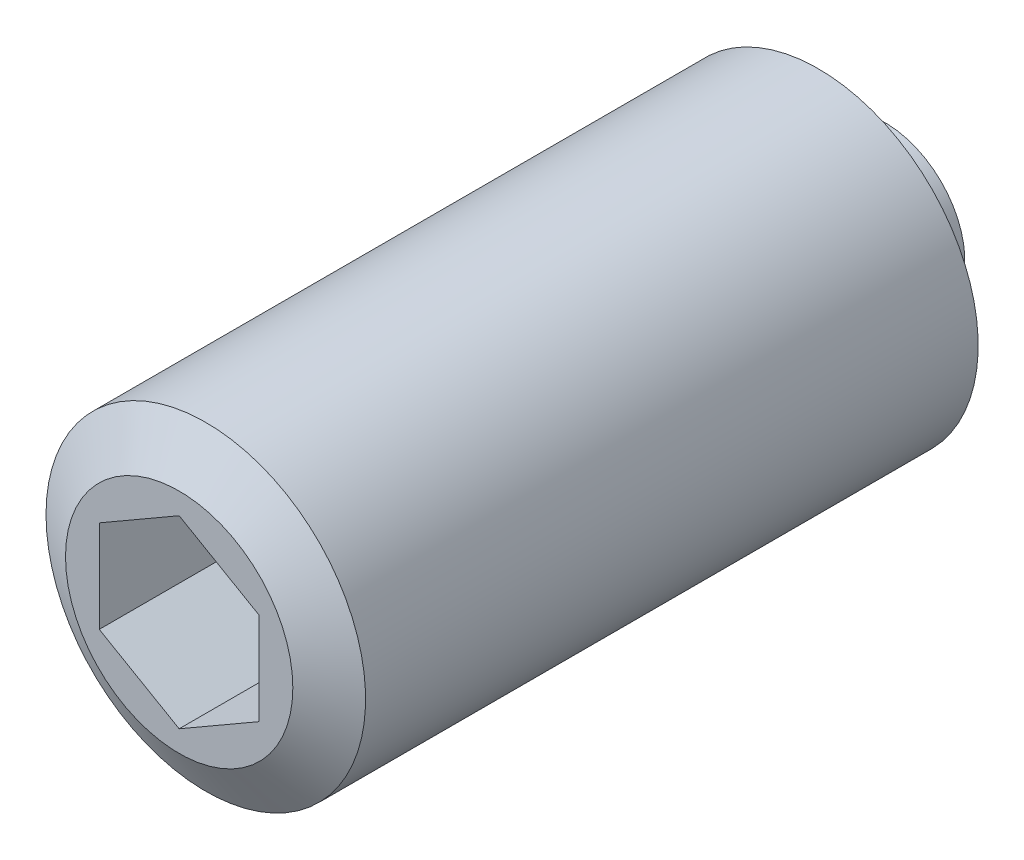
ISO-10303-21;
HEADER;
FILE_DESCRIPTION(('STEP AP214'),'2;1');
FILE_NAME('part.step','',(''),(''),'','','');
FILE_SCHEMA(('AUTOMOTIVE_DESIGN { 1 0 10303 214 1 1 1 1 }'));
ENDSEC;
DATA;
#1=APPLICATION_CONTEXT('core data for automotive mechanical design processes');
#2=APPLICATION_PROTOCOL_DEFINITION('international standard','automotive_design',2000,#1);
#3=PRODUCT_CONTEXT('',#1,'mechanical');
#4=PRODUCT('Part','Part','',(#3));
#5=PRODUCT_RELATED_PRODUCT_CATEGORY('part','',(#4));
#6=PRODUCT_DEFINITION_FORMATION('','',#4);
#7=PRODUCT_DEFINITION_CONTEXT('part definition',#1,'design');
#8=PRODUCT_DEFINITION('design','',#6,#7);
#9=PRODUCT_DEFINITION_SHAPE('','',#8);
#10=(LENGTH_UNIT() NAMED_UNIT(*) SI_UNIT(.MILLI.,.METRE.));
#11=(NAMED_UNIT(*) PLANE_ANGLE_UNIT() SI_UNIT($,.RADIAN.));
#12=(NAMED_UNIT(*) SI_UNIT($,.STERADIAN.) SOLID_ANGLE_UNIT());
#13=UNCERTAINTY_MEASURE_WITH_UNIT(LENGTH_MEASURE(1.E-05),#10,'distance_accuracy_value','');
#14=(GEOMETRIC_REPRESENTATION_CONTEXT(3) GLOBAL_UNCERTAINTY_ASSIGNED_CONTEXT((#13)) GLOBAL_UNIT_ASSIGNED_CONTEXT((#10,
#11,#12)) REPRESENTATION_CONTEXT('',''));
#15=CARTESIAN_POINT('',(0.,0.,0.));
#16=DIRECTION('',(0.,0.,1.));
#17=DIRECTION('',(1.,0.,0.));
#18=AXIS2_PLACEMENT_3D('',#15,#16,#17);
#19=CARTESIAN_POINT('',(0.,0.,26.5));
#20=DIRECTION('',(0.,0.,-1.));
#21=DIRECTION('',(-1.,0.,0.));
#22=AXIS2_PLACEMENT_3D('',#19,#20,#21);
#23=PLANE('',#22);
#24=DIRECTION('',(-0.866025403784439,-0.5,0.));
#25=VECTOR('',#24,1.);
#26=CARTESIAN_POINT('',(0.,3.46410161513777,26.5));
#27=LINE('',#26,#25);
#28=CARTESIAN_POINT('',(0.,3.46410161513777,26.5));
#29=VERTEX_POINT('',#28);
#30=CARTESIAN_POINT('',(-3.,1.73205080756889,26.5));
#31=VERTEX_POINT('',#30);
#32=EDGE_CURVE('E102',#29,#31,#27,.T.);
#33=ORIENTED_EDGE('',*,*,#32,.F.);
#34=DIRECTION('',(-0.866025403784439,0.5,0.));
#35=VECTOR('',#34,1.);
#36=CARTESIAN_POINT('',(3.,1.73205080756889,26.5));
#37=LINE('',#36,#35);
#38=CARTESIAN_POINT('',(3.,1.73205080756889,26.5));
#39=VERTEX_POINT('',#38);
#40=EDGE_CURVE('E28',#39,#29,#37,.T.);
#41=ORIENTED_EDGE('',*,*,#40,.F.);
#42=DIRECTION('',(0.,1.,0.));
#43=VECTOR('',#42,1.);
#44=CARTESIAN_POINT('',(3.,-1.73205080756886,26.5));
#45=LINE('',#44,#43);
#46=CARTESIAN_POINT('',(3.,-1.73205080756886,26.5));
#47=VERTEX_POINT('',#46);
#48=EDGE_CURVE('E111',#47,#39,#45,.T.);
#49=ORIENTED_EDGE('',*,*,#48,.F.);
#50=DIRECTION('',(0.866025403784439,0.5,0.));
#51=VECTOR('',#50,1.);
#52=CARTESIAN_POINT('',(0.,-3.46410161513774,26.5));
#53=LINE('',#52,#51);
#54=CARTESIAN_POINT('',(0.,-3.46410161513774,26.5));
#55=VERTEX_POINT('',#54);
#56=EDGE_CURVE('E109',#55,#47,#53,.T.);
#57=ORIENTED_EDGE('',*,*,#56,.F.);
#58=DIRECTION('',(0.866025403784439,-0.5,0.));
#59=VECTOR('',#58,1.);
#60=CARTESIAN_POINT('',(-3.,-1.73205080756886,26.5));
#61=LINE('',#60,#59);
#62=CARTESIAN_POINT('',(-3.,-1.73205080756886,26.5));
#63=VERTEX_POINT('',#62);
#64=EDGE_CURVE('E76',#63,#55,#61,.T.);
#65=ORIENTED_EDGE('',*,*,#64,.F.);
#66=DIRECTION('',(0.,-1.,0.));
#67=VECTOR('',#66,1.);
#68=CARTESIAN_POINT('',(-3.,1.73205080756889,26.5));
#69=LINE('',#68,#67);
#70=EDGE_CURVE('E105',#31,#63,#69,.T.);
#71=ORIENTED_EDGE('',*,*,#70,.F.);
#72=EDGE_LOOP('',(#33,#41,#49,#57,#65,#71));
#73=FACE_BOUND('',#72,.T.);
#74=CARTESIAN_POINT('',(0.,0.,26.5));
#75=DIRECTION('',(0.,0.,-1.));
#76=DIRECTION('',(-1.,0.,0.));
#77=AXIS2_PLACEMENT_3D('',#74,#75,#76);
#78=CIRCLE('',#77,4.267949);
#79=CARTESIAN_POINT('',(-4.267949,0.,26.5));
#80=VERTEX_POINT('',#79);
#81=EDGE_CURVE('E9',#80,#80,#78,.T.);
#82=ORIENTED_EDGE('',*,*,#81,.F.);
#83=EDGE_LOOP('',(#82));
#84=FACE_BOUND('',#83,.T.);
#85=ADVANCED_FACE('F14',(#73,#84),#23,.F.);
#86=CARTESIAN_POINT('',(0.,0.,26.5));
#87=DIRECTION('',(0.,0.,-1.));
#88=DIRECTION('',(-1.,0.,0.));
#89=AXIS2_PLACEMENT_3D('',#86,#87,#88);
#90=CONICAL_SURFACE('',#89,4.267949,1.04719759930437);
#91=CARTESIAN_POINT('',(0.,0.,25.5));
#92=DIRECTION('',(0.,0.,-1.));
#93=DIRECTION('',(-1.,0.,0.));
#94=AXIS2_PLACEMENT_3D('',#91,#92,#93);
#95=CIRCLE('',#94,6.);
#96=CARTESIAN_POINT('',(-6.,0.,25.5));
#97=VERTEX_POINT('',#96);
#98=EDGE_CURVE('E21',#97,#97,#95,.T.);
#99=ORIENTED_EDGE('',*,*,#98,.F.);
#100=EDGE_LOOP('',(#99));
#101=FACE_BOUND('',#100,.T.);
#102=ORIENTED_EDGE('',*,*,#81,.T.);
#103=EDGE_LOOP('',(#102));
#104=FACE_BOUND('',#103,.T.);
#105=ADVANCED_FACE('F136',(#101,#104),#90,.T.);
#106=CARTESIAN_POINT('',(0.,0.,0.));
#107=DIRECTION('',(0.,0.,-1.));
#108=DIRECTION('',(-1.,0.,0.));
#109=AXIS2_PLACEMENT_3D('',#106,#107,#108);
#110=CYLINDRICAL_SURFACE('',#109,6.);
#111=CARTESIAN_POINT('',(0.,0.,2.5));
#112=DIRECTION('',(0.,0.,-1.));
#113=DIRECTION('',(-1.,0.,0.));
#114=AXIS2_PLACEMENT_3D('',#111,#112,#113);
#115=CIRCLE('',#114,6.);
#116=CARTESIAN_POINT('',(-6.,0.,2.5));
#117=VERTEX_POINT('',#116);
#118=EDGE_CURVE('E129',#117,#117,#115,.T.);
#119=ORIENTED_EDGE('',*,*,#118,.F.);
#120=EDGE_LOOP('',(#119));
#121=FACE_BOUND('',#120,.T.);
#122=ORIENTED_EDGE('',*,*,#98,.T.);
#123=EDGE_LOOP('',(#122));
#124=FACE_BOUND('',#123,.T.);
#125=ADVANCED_FACE('F134',(#121,#124),#110,.T.);
#126=CARTESIAN_POINT('',(0.,0.,2.5));
#127=DIRECTION('',(0.,0.,1.));
#128=DIRECTION('',(1.,0.,0.));
#129=AXIS2_PLACEMENT_3D('',#126,#127,#128);
#130=CONICAL_SURFACE('',#129,6.,1.04719759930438);
#131=CARTESIAN_POINT('',(0.,0.,1.5));
#132=DIRECTION('',(0.,0.,-1.));
#133=DIRECTION('',(-1.,0.,0.));
#134=AXIS2_PLACEMENT_3D('',#131,#132,#133);
#135=CIRCLE('',#134,4.267949);
#136=CARTESIAN_POINT('',(-4.267949,0.,1.5));
#137=VERTEX_POINT('',#136);
#138=EDGE_CURVE('E126',#137,#137,#135,.T.);
#139=ORIENTED_EDGE('',*,*,#138,.F.);
#140=EDGE_LOOP('',(#139));
#141=FACE_BOUND('',#140,.T.);
#142=ORIENTED_EDGE('',*,*,#118,.T.);
#143=EDGE_LOOP('',(#142));
#144=FACE_BOUND('',#143,.T.);
#145=ADVANCED_FACE('F176',(#141,#144),#130,.T.);
#146=CARTESIAN_POINT('',(0.,3.,1.5));
#147=DIRECTION('',(0.,0.,1.));
#148=DIRECTION('',(1.,0.,0.));
#149=AXIS2_PLACEMENT_3D('',#146,#147,#148);
#150=PLANE('',#149);
#151=CARTESIAN_POINT('',(0.,0.,1.5));
#152=DIRECTION('',(0.,0.,-1.));
#153=DIRECTION('',(-1.,0.,0.));
#154=AXIS2_PLACEMENT_3D('',#151,#152,#153);
#155=CIRCLE('',#154,3.);
#156=CARTESIAN_POINT('',(-3.,0.,1.5));
#157=VERTEX_POINT('',#156);
#158=EDGE_CURVE('E123',#157,#157,#155,.T.);
#159=ORIENTED_EDGE('',*,*,#158,.F.);
#160=EDGE_LOOP('',(#159));
#161=FACE_BOUND('',#160,.T.);
#162=ORIENTED_EDGE('',*,*,#138,.T.);
#163=EDGE_LOOP('',(#162));
#164=FACE_BOUND('',#163,.T.);
#165=ADVANCED_FACE('F172',(#161,#164),#150,.F.);
#166=CARTESIAN_POINT('',(0.,0.,0.));
#167=DIRECTION('',(0.,0.,-1.));
#168=DIRECTION('',(-1.,0.,0.));
#169=AXIS2_PLACEMENT_3D('',#166,#167,#168);
#170=CYLINDRICAL_SURFACE('',#169,3.);
#171=CARTESIAN_POINT('',(0.,0.,0.));
#172=DIRECTION('',(0.,0.,-1.));
#173=DIRECTION('',(-1.,0.,0.));
#174=AXIS2_PLACEMENT_3D('',#171,#172,#173);
#175=CIRCLE('',#174,3.);
#176=CARTESIAN_POINT('',(-3.,0.,0.));
#177=VERTEX_POINT('',#176);
#178=EDGE_CURVE('E115',#177,#177,#175,.T.);
#179=ORIENTED_EDGE('',*,*,#178,.F.);
#180=EDGE_LOOP('',(#179));
#181=FACE_BOUND('',#180,.T.);
#182=ORIENTED_EDGE('',*,*,#158,.T.);
#183=EDGE_LOOP('',(#182));
#184=FACE_BOUND('',#183,.T.);
#185=ADVANCED_FACE('F164',(#181,#184),#170,.T.);
#186=CARTESIAN_POINT('',(0.,0.,0.));
#187=DIRECTION('',(0.,0.,1.));
#188=DIRECTION('',(1.,0.,0.));
#189=AXIS2_PLACEMENT_3D('',#186,#187,#188);
#190=PLANE('',#189);
#191=ORIENTED_EDGE('',*,*,#178,.T.);
#192=EDGE_LOOP('',(#191));
#193=FACE_BOUND('',#192,.T.);
#194=ADVANCED_FACE('F156',(#193),#190,.F.);
#195=CARTESIAN_POINT('',(3.,1.73205080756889,21.5));
#196=DIRECTION('',(0.5,0.866025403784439,0.));
#197=DIRECTION('',(0.866025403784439,-0.5,0.));
#198=AXIS2_PLACEMENT_3D('',#195,#196,#197);
#199=PLANE('',#198);
#200=ORIENTED_EDGE('',*,*,#40,.T.);
#201=DIRECTION('',(0.,0.,1.));
#202=VECTOR('',#201,1.);
#203=CARTESIAN_POINT('',(0.,3.46410161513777,21.5));
#204=LINE('',#203,#202);
#205=CARTESIAN_POINT('',(0.,3.46410161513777,21.5));
#206=VERTEX_POINT('',#205);
#207=EDGE_CURVE('E58',#206,#29,#204,.T.);
#208=ORIENTED_EDGE('',*,*,#207,.F.);
#209=DIRECTION('',(-0.866025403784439,0.5,0.));
#210=VECTOR('',#209,1.);
#211=CARTESIAN_POINT('',(3.,1.73205080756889,21.5));
#212=LINE('',#211,#210);
#213=CARTESIAN_POINT('',(3.,1.73205080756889,21.5));
#214=VERTEX_POINT('',#213);
#215=EDGE_CURVE('E113',#214,#206,#212,.T.);
#216=ORIENTED_EDGE('',*,*,#215,.F.);
#217=DIRECTION('',(0.,0.,1.));
#218=VECTOR('',#217,1.);
#219=CARTESIAN_POINT('',(3.,1.73205080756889,21.5));
#220=LINE('',#219,#218);
#221=EDGE_CURVE('E36',#214,#39,#220,.T.);
#222=ORIENTED_EDGE('',*,*,#221,.T.);
#223=EDGE_LOOP('',(#200,#208,#216,#222));
#224=FACE_BOUND('',#223,.T.);
#225=ADVANCED_FACE('F153',(#224),#199,.F.);
#226=CARTESIAN_POINT('',(3.,-1.73205080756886,21.5));
#227=DIRECTION('',(1.,0.,0.));
#228=DIRECTION('',(0.,0.,-1.));
#229=AXIS2_PLACEMENT_3D('',#226,#227,#228);
#230=PLANE('',#229);
#231=ORIENTED_EDGE('',*,*,#48,.T.);
#232=ORIENTED_EDGE('',*,*,#221,.F.);
#233=DIRECTION('',(0.,1.,0.));
#234=VECTOR('',#233,1.);
#235=CARTESIAN_POINT('',(3.,-1.73205080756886,21.5));
#236=LINE('',#235,#234);
#237=CARTESIAN_POINT('',(3.,-1.73205080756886,21.5));
#238=VERTEX_POINT('',#237);
#239=EDGE_CURVE('E88',#238,#214,#236,.T.);
#240=ORIENTED_EDGE('',*,*,#239,.F.);
#241=DIRECTION('',(0.,0.,1.));
#242=VECTOR('',#241,1.);
#243=CARTESIAN_POINT('',(3.,-1.73205080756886,21.5));
#244=LINE('',#243,#242);
#245=EDGE_CURVE('E80',#238,#47,#244,.T.);
#246=ORIENTED_EDGE('',*,*,#245,.T.);
#247=EDGE_LOOP('',(#231,#232,#240,#246));
#248=FACE_BOUND('',#247,.T.);
#249=ADVANCED_FACE('F155',(#248),#230,.F.);
#250=CARTESIAN_POINT('',(0.,-3.46410161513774,21.5));
#251=DIRECTION('',(0.5,-0.866025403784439,0.));
#252=DIRECTION('',(-0.866025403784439,-0.5,0.));
#253=AXIS2_PLACEMENT_3D('',#250,#251,#252);
#254=PLANE('',#253);
#255=ORIENTED_EDGE('',*,*,#56,.T.);
#256=ORIENTED_EDGE('',*,*,#245,.F.);
#257=DIRECTION('',(0.866025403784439,0.5,0.));
#258=VECTOR('',#257,1.);
#259=CARTESIAN_POINT('',(0.,-3.46410161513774,21.5));
#260=LINE('',#259,#258);
#261=CARTESIAN_POINT('',(0.,-3.46410161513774,21.5));
#262=VERTEX_POINT('',#261);
#263=EDGE_CURVE('E84',#262,#238,#260,.T.);
#264=ORIENTED_EDGE('',*,*,#263,.F.);
#265=DIRECTION('',(0.,0.,1.));
#266=VECTOR('',#265,1.);
#267=CARTESIAN_POINT('',(0.,-3.46410161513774,21.5));
#268=LINE('',#267,#266);
#269=EDGE_CURVE('E69',#262,#55,#268,.T.);
#270=ORIENTED_EDGE('',*,*,#269,.T.);
#271=EDGE_LOOP('',(#255,#256,#264,#270));
#272=FACE_BOUND('',#271,.T.);
#273=ADVANCED_FACE('F85',(#272),#254,.F.);
#274=CARTESIAN_POINT('',(-3.,-1.73205080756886,21.5));
#275=DIRECTION('',(-0.5,-0.866025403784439,0.));
#276=DIRECTION('',(-0.866025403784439,0.5,0.));
#277=AXIS2_PLACEMENT_3D('',#274,#275,#276);
#278=PLANE('',#277);
#279=ORIENTED_EDGE('',*,*,#64,.T.);
#280=ORIENTED_EDGE('',*,*,#269,.F.);
#281=DIRECTION('',(0.866025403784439,-0.5,0.));
#282=VECTOR('',#281,1.);
#283=CARTESIAN_POINT('',(-3.,-1.73205080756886,21.5));
#284=LINE('',#283,#282);
#285=CARTESIAN_POINT('',(-3.,-1.73205080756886,21.5));
#286=VERTEX_POINT('',#285);
#287=EDGE_CURVE('E73',#286,#262,#284,.T.);
#288=ORIENTED_EDGE('',*,*,#287,.F.);
#289=DIRECTION('',(0.,0.,1.));
#290=VECTOR('',#289,1.);
#291=CARTESIAN_POINT('',(-3.,-1.73205080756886,21.5));
#292=LINE('',#291,#290);
#293=EDGE_CURVE('E81',#286,#63,#292,.T.);
#294=ORIENTED_EDGE('',*,*,#293,.T.);
#295=EDGE_LOOP('',(#279,#280,#288,#294));
#296=FACE_BOUND('',#295,.T.);
#297=ADVANCED_FACE('F71',(#296),#278,.F.);
#298=CARTESIAN_POINT('',(-3.,1.73205080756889,21.5));
#299=DIRECTION('',(-1.,0.,0.));
#300=DIRECTION('',(0.,0.,1.));
#301=AXIS2_PLACEMENT_3D('',#298,#299,#300);
#302=PLANE('',#301);
#303=ORIENTED_EDGE('',*,*,#70,.T.);
#304=ORIENTED_EDGE('',*,*,#293,.F.);
#305=DIRECTION('',(0.,-1.,0.));
#306=VECTOR('',#305,1.);
#307=CARTESIAN_POINT('',(-3.,1.73205080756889,21.5));
#308=LINE('',#307,#306);
#309=CARTESIAN_POINT('',(-3.,1.73205080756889,21.5));
#310=VERTEX_POINT('',#309);
#311=EDGE_CURVE('E94',#310,#286,#308,.T.);
#312=ORIENTED_EDGE('',*,*,#311,.F.);
#313=DIRECTION('',(0.,0.,1.));
#314=VECTOR('',#313,1.);
#315=CARTESIAN_POINT('',(-3.,1.73205080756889,21.5));
#316=LINE('',#315,#314);
#317=EDGE_CURVE('E118',#310,#31,#316,.T.);
#318=ORIENTED_EDGE('',*,*,#317,.T.);
#319=EDGE_LOOP('',(#303,#304,#312,#318));
#320=FACE_BOUND('',#319,.T.);
#321=ADVANCED_FACE('F252',(#320),#302,.F.);
#322=CARTESIAN_POINT('',(0.,3.46410161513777,21.5));
#323=DIRECTION('',(-0.5,0.866025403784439,0.));
#324=DIRECTION('',(0.866025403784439,0.5,0.));
#325=AXIS2_PLACEMENT_3D('',#322,#323,#324);
#326=PLANE('',#325);
#327=ORIENTED_EDGE('',*,*,#32,.T.);
#328=ORIENTED_EDGE('',*,*,#317,.F.);
#329=DIRECTION('',(-0.866025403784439,-0.5,0.));
#330=VECTOR('',#329,1.);
#331=CARTESIAN_POINT('',(0.,3.46410161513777,21.5));
#332=LINE('',#331,#330);
#333=EDGE_CURVE('E96',#206,#310,#332,.T.);
#334=ORIENTED_EDGE('',*,*,#333,.F.);
#335=ORIENTED_EDGE('',*,*,#207,.T.);
#336=EDGE_LOOP('',(#327,#328,#334,#335));
#337=FACE_BOUND('',#336,.T.);
#338=ADVANCED_FACE('F151',(#337),#326,.F.);
#339=CARTESIAN_POINT('',(0.,3.46410161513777,21.5));
#340=DIRECTION('',(0.,0.,1.));
#341=DIRECTION('',(1.,0.,0.));
#342=AXIS2_PLACEMENT_3D('',#339,#340,#341);
#343=PLANE('',#342);
#344=ORIENTED_EDGE('',*,*,#215,.T.);
#345=ORIENTED_EDGE('',*,*,#333,.T.);
#346=ORIENTED_EDGE('',*,*,#311,.T.);
#347=ORIENTED_EDGE('',*,*,#287,.T.);
#348=ORIENTED_EDGE('',*,*,#263,.T.);
#349=ORIENTED_EDGE('',*,*,#239,.T.);
#350=EDGE_LOOP('',(#344,#345,#346,#347,#348,#349));
#351=FACE_BOUND('',#350,.T.);
#352=ADVANCED_FACE('F91',(#351),#343,.T.);
#353=CLOSED_SHELL('',(#85,#105,#125,#145,#165,#185,#194,#225,#249,#273,#297,#321,#338,#352));
#354=MANIFOLD_SOLID_BREP('B1',#353);
#355=ADVANCED_BREP_SHAPE_REPRESENTATION('',(#18,#354),#14);
#356=SHAPE_DEFINITION_REPRESENTATION(#9,#355);
ENDSEC;
END-ISO-10303-21;
